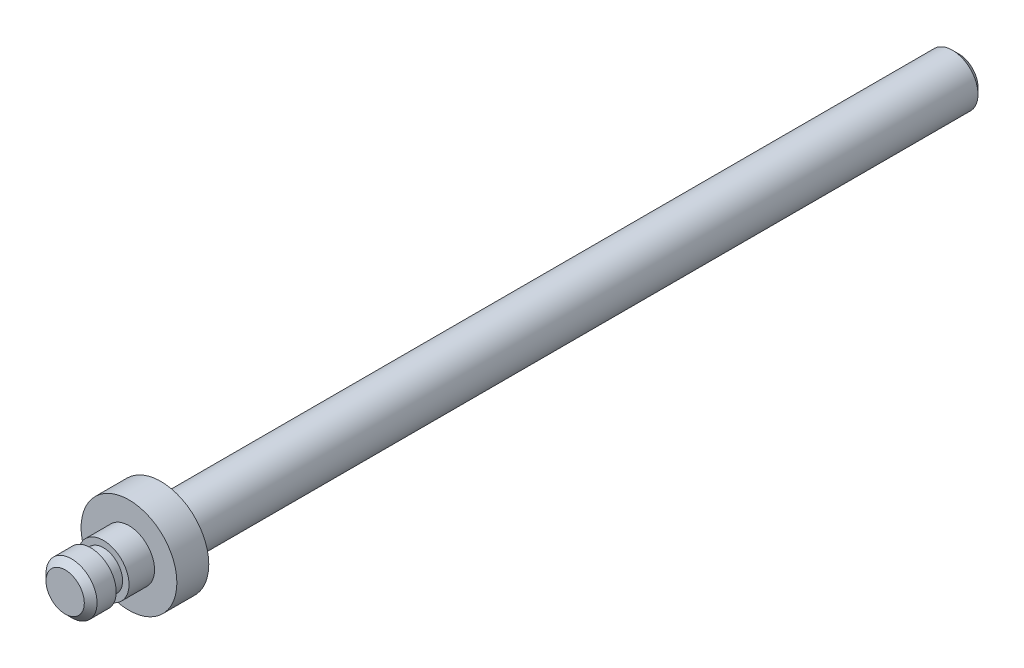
ISO-10303-21;
HEADER;
FILE_DESCRIPTION(('STEP AP214'),'2;1');
FILE_NAME('part.step','',(''),(''),'','','');
FILE_SCHEMA(('AUTOMOTIVE_DESIGN { 1 0 10303 214 1 1 1 1 }'));
ENDSEC;
DATA;
#1=APPLICATION_CONTEXT('core data for automotive mechanical design processes');
#2=APPLICATION_PROTOCOL_DEFINITION('international standard','automotive_design',2000,#1);
#3=PRODUCT_CONTEXT('',#1,'mechanical');
#4=PRODUCT('Part','Part','',(#3));
#5=PRODUCT_RELATED_PRODUCT_CATEGORY('part','',(#4));
#6=PRODUCT_DEFINITION_FORMATION('','',#4);
#7=PRODUCT_DEFINITION_CONTEXT('part definition',#1,'design');
#8=PRODUCT_DEFINITION('design','',#6,#7);
#9=PRODUCT_DEFINITION_SHAPE('','',#8);
#10=(LENGTH_UNIT() NAMED_UNIT(*) SI_UNIT(.MILLI.,.METRE.));
#11=(NAMED_UNIT(*) PLANE_ANGLE_UNIT() SI_UNIT($,.RADIAN.));
#12=(NAMED_UNIT(*) SI_UNIT($,.STERADIAN.) SOLID_ANGLE_UNIT());
#13=UNCERTAINTY_MEASURE_WITH_UNIT(LENGTH_MEASURE(1.E-05),#10,'distance_accuracy_value','');
#14=(GEOMETRIC_REPRESENTATION_CONTEXT(3) GLOBAL_UNCERTAINTY_ASSIGNED_CONTEXT((#13)) GLOBAL_UNIT_ASSIGNED_CONTEXT((#10,
#11,#12)) REPRESENTATION_CONTEXT('',''));
#15=CARTESIAN_POINT('',(0.,0.,0.));
#16=DIRECTION('',(0.,0.,1.));
#17=DIRECTION('',(1.,0.,0.));
#18=AXIS2_PLACEMENT_3D('',#15,#16,#17);
#19=CARTESIAN_POINT('',(0.,0.,140.));
#20=DIRECTION('',(0.,0.,-1.));
#21=DIRECTION('',(-1.,0.,0.));
#22=AXIS2_PLACEMENT_3D('',#19,#20,#21);
#23=CYLINDRICAL_SURFACE('',#22,4.);
#24=CARTESIAN_POINT('',(0.,0.,130.));
#25=DIRECTION('',(0.,0.,1.));
#26=DIRECTION('',(1.,0.,0.));
#27=AXIS2_PLACEMENT_3D('',#24,#25,#26);
#28=CIRCLE('',#27,4.);
#29=CARTESIAN_POINT('',(4.,0.,130.));
#30=VERTEX_POINT('',#29);
#31=EDGE_CURVE('E56',#30,#30,#28,.T.);
#32=ORIENTED_EDGE('',*,*,#31,.T.);
#33=EDGE_LOOP('',(#32));
#34=FACE_BOUND('',#33,.T.);
#35=CARTESIAN_POINT('',(0.,0.,134.));
#36=DIRECTION('',(0.,0.,1.));
#37=DIRECTION('',(1.,0.,0.));
#38=AXIS2_PLACEMENT_3D('',#35,#36,#37);
#39=CIRCLE('',#38,4.);
#40=CARTESIAN_POINT('',(4.,0.,134.));
#41=VERTEX_POINT('',#40);
#42=EDGE_CURVE('E61',#41,#41,#39,.T.);
#43=ORIENTED_EDGE('',*,*,#42,.F.);
#44=EDGE_LOOP('',(#43));
#45=FACE_BOUND('',#44,.T.);
#46=ADVANCED_FACE('F29',(#34,#45),#23,.T.);
#47=CARTESIAN_POINT('',(0.,0.,130.));
#48=DIRECTION('',(0.,0.,1.));
#49=DIRECTION('',(1.,0.,0.));
#50=AXIS2_PLACEMENT_3D('',#47,#48,#49);
#51=PLANE('',#50);
#52=CARTESIAN_POINT('',(0.,0.,130.));
#53=DIRECTION('',(0.,0.,1.));
#54=DIRECTION('',(1.,0.,0.));
#55=AXIS2_PLACEMENT_3D('',#52,#53,#54);
#56=CIRCLE('',#55,7.5);
#57=CARTESIAN_POINT('',(7.5,0.,130.));
#58=VERTEX_POINT('',#57);
#59=EDGE_CURVE('E52',#58,#58,#56,.T.);
#60=ORIENTED_EDGE('',*,*,#59,.T.);
#61=EDGE_LOOP('',(#60));
#62=FACE_BOUND('',#61,.T.);
#63=ORIENTED_EDGE('',*,*,#31,.F.);
#64=EDGE_LOOP('',(#63));
#65=FACE_BOUND('',#64,.T.);
#66=ADVANCED_FACE('F86',(#62,#65),#51,.T.);
#67=CARTESIAN_POINT('',(0.,0.,125.));
#68=DIRECTION('',(0.,0.,-1.));
#69=DIRECTION('',(-1.,0.,0.));
#70=AXIS2_PLACEMENT_3D('',#67,#68,#69);
#71=CYLINDRICAL_SURFACE('',#70,4.);
#72=CARTESIAN_POINT('',(0.,0.,0.999999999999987));
#73=DIRECTION('',(0.,0.,1.));
#74=DIRECTION('',(1.,0.,0.));
#75=AXIS2_PLACEMENT_3D('',#72,#73,#74);
#76=CIRCLE('',#75,4.);
#77=CARTESIAN_POINT('',(4.,0.,0.999999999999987));
#78=VERTEX_POINT('',#77);
#79=EDGE_CURVE('E44',#78,#78,#76,.T.);
#80=ORIENTED_EDGE('',*,*,#79,.T.);
#81=EDGE_LOOP('',(#80));
#82=FACE_BOUND('',#81,.T.);
#83=CARTESIAN_POINT('',(0.,0.,125.));
#84=DIRECTION('',(0.,0.,1.));
#85=DIRECTION('',(1.,0.,0.));
#86=AXIS2_PLACEMENT_3D('',#83,#84,#85);
#87=CIRCLE('',#86,4.);
#88=CARTESIAN_POINT('',(4.,0.,125.));
#89=VERTEX_POINT('',#88);
#90=EDGE_CURVE('E49',#89,#89,#87,.T.);
#91=ORIENTED_EDGE('',*,*,#90,.F.);
#92=EDGE_LOOP('',(#91));
#93=FACE_BOUND('',#92,.T.);
#94=ADVANCED_FACE('F93',(#82,#93),#71,.T.);
#95=CARTESIAN_POINT('',(0.,0.,0.));
#96=DIRECTION('',(0.,0.,1.));
#97=DIRECTION('',(1.,0.,0.));
#98=AXIS2_PLACEMENT_3D('',#95,#96,#97);
#99=PLANE('',#98);
#100=CARTESIAN_POINT('',(0.,0.,0.));
#101=DIRECTION('',(0.,0.,1.));
#102=DIRECTION('',(1.,0.,0.));
#103=AXIS2_PLACEMENT_3D('',#100,#101,#102);
#104=CIRCLE('',#103,3.00000000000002);
#105=CARTESIAN_POINT('',(3.00000000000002,0.,0.));
#106=VERTEX_POINT('',#105);
#107=EDGE_CURVE('E40',#106,#106,#104,.F.);
#108=ORIENTED_EDGE('',*,*,#107,.T.);
#109=EDGE_LOOP('',(#108));
#110=FACE_BOUND('',#109,.T.);
#111=ADVANCED_FACE('F174',(#110),#99,.F.);
#112=CARTESIAN_POINT('',(0.,0.,125.));
#113=DIRECTION('',(0.,0.,1.));
#114=DIRECTION('',(1.,0.,0.));
#115=AXIS2_PLACEMENT_3D('',#112,#113,#114);
#116=PLANE('',#115);
#117=CARTESIAN_POINT('',(0.,0.,125.));
#118=DIRECTION('',(0.,0.,1.));
#119=DIRECTION('',(1.,0.,0.));
#120=AXIS2_PLACEMENT_3D('',#117,#118,#119);
#121=CIRCLE('',#120,7.5);
#122=CARTESIAN_POINT('',(7.5,0.,125.));
#123=VERTEX_POINT('',#122);
#124=EDGE_CURVE('E53',#123,#123,#121,.T.);
#125=ORIENTED_EDGE('',*,*,#124,.F.);
#126=EDGE_LOOP('',(#125));
#127=FACE_BOUND('',#126,.T.);
#128=ORIENTED_EDGE('',*,*,#90,.T.);
#129=EDGE_LOOP('',(#128));
#130=FACE_BOUND('',#129,.T.);
#131=ADVANCED_FACE('F166',(#127,#130),#116,.F.);
#132=CARTESIAN_POINT('',(0.,0.,130.));
#133=DIRECTION('',(0.,0.,-1.));
#134=DIRECTION('',(-1.,0.,0.));
#135=AXIS2_PLACEMENT_3D('',#132,#133,#134);
#136=CYLINDRICAL_SURFACE('',#135,7.5);
#137=ORIENTED_EDGE('',*,*,#59,.F.);
#138=EDGE_LOOP('',(#137));
#139=FACE_BOUND('',#138,.T.);
#140=ORIENTED_EDGE('',*,*,#124,.T.);
#141=EDGE_LOOP('',(#140));
#142=FACE_BOUND('',#141,.T.);
#143=ADVANCED_FACE('F162',(#139,#142),#136,.T.);
#144=CARTESIAN_POINT('',(0.,0.,0.999999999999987));
#145=DIRECTION('',(0.,0.,1.));
#146=DIRECTION('',(1.,0.,0.));
#147=AXIS2_PLACEMENT_3D('',#144,#145,#146);
#148=CONICAL_SURFACE('',#147,4.,0.785398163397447);
#149=ORIENTED_EDGE('',*,*,#107,.F.);
#150=EDGE_LOOP('',(#149));
#151=FACE_BOUND('',#150,.T.);
#152=ORIENTED_EDGE('',*,*,#79,.F.);
#153=EDGE_LOOP('',(#152));
#154=FACE_BOUND('',#153,.T.);
#155=ADVANCED_FACE('F81',(#151,#154),#148,.T.);
#156=CARTESIAN_POINT('',(0.,0.,134.));
#157=DIRECTION('',(0.,0.,1.));
#158=DIRECTION('',(1.,0.,0.));
#159=AXIS2_PLACEMENT_3D('',#156,#157,#158);
#160=PLANE('',#159);
#161=CARTESIAN_POINT('',(0.,0.,134.));
#162=DIRECTION('',(0.,0.,1.));
#163=DIRECTION('',(1.,0.,0.));
#164=AXIS2_PLACEMENT_3D('',#161,#162,#163);
#165=CIRCLE('',#164,3.);
#166=CARTESIAN_POINT('',(3.,0.,134.));
#167=VERTEX_POINT('',#166);
#168=EDGE_CURVE('E65',#167,#167,#165,.T.);
#169=ORIENTED_EDGE('',*,*,#168,.F.);
#170=EDGE_LOOP('',(#169));
#171=FACE_BOUND('',#170,.T.);
#172=ORIENTED_EDGE('',*,*,#42,.T.);
#173=EDGE_LOOP('',(#172));
#174=FACE_BOUND('',#173,.T.);
#175=ADVANCED_FACE('F77',(#171,#174),#160,.T.);
#176=CARTESIAN_POINT('',(0.,0.,136.));
#177=DIRECTION('',(0.,0.,1.));
#178=DIRECTION('',(1.,0.,0.));
#179=AXIS2_PLACEMENT_3D('',#176,#177,#178);
#180=PLANE('',#179);
#181=CARTESIAN_POINT('',(0.,0.,136.));
#182=DIRECTION('',(0.,0.,1.));
#183=DIRECTION('',(1.,0.,0.));
#184=AXIS2_PLACEMENT_3D('',#181,#182,#183);
#185=CIRCLE('',#184,3.);
#186=CARTESIAN_POINT('',(3.,0.,136.));
#187=VERTEX_POINT('',#186);
#188=EDGE_CURVE('E68',#187,#187,#185,.T.);
#189=ORIENTED_EDGE('',*,*,#188,.T.);
#190=EDGE_LOOP('',(#189));
#191=FACE_BOUND('',#190,.T.);
#192=CARTESIAN_POINT('',(0.,0.,136.));
#193=DIRECTION('',(0.,0.,1.));
#194=DIRECTION('',(1.,0.,0.));
#195=AXIS2_PLACEMENT_3D('',#192,#193,#194);
#196=CIRCLE('',#195,4.);
#197=CARTESIAN_POINT('',(4.,0.,136.));
#198=VERTEX_POINT('',#197);
#199=EDGE_CURVE('E62',#198,#198,#196,.T.);
#200=ORIENTED_EDGE('',*,*,#199,.F.);
#201=EDGE_LOOP('',(#200));
#202=FACE_BOUND('',#201,.T.);
#203=ADVANCED_FACE('F80',(#191,#202),#180,.F.);
#204=CARTESIAN_POINT('',(0.,0.,134.));
#205=DIRECTION('',(0.,0.,1.));
#206=DIRECTION('',(1.,0.,0.));
#207=AXIS2_PLACEMENT_3D('',#204,#205,#206);
#208=CYLINDRICAL_SURFACE('',#207,3.);
#209=ORIENTED_EDGE('',*,*,#168,.T.);
#210=EDGE_LOOP('',(#209));
#211=FACE_BOUND('',#210,.T.);
#212=ORIENTED_EDGE('',*,*,#188,.F.);
#213=EDGE_LOOP('',(#212));
#214=FACE_BOUND('',#213,.T.);
#215=ADVANCED_FACE('F74',(#211,#214),#208,.T.);
#216=CARTESIAN_POINT('',(0.,0.,140.));
#217=DIRECTION('',(0.,0.,1.));
#218=DIRECTION('',(1.,0.,0.));
#219=AXIS2_PLACEMENT_3D('',#216,#217,#218);
#220=PLANE('',#219);
#221=CARTESIAN_POINT('',(0.,0.,140.));
#222=DIRECTION('',(0.,0.,1.));
#223=DIRECTION('',(1.,0.,0.));
#224=AXIS2_PLACEMENT_3D('',#221,#222,#223);
#225=CIRCLE('',#224,3.);
#226=CARTESIAN_POINT('',(3.,0.,140.));
#227=VERTEX_POINT('',#226);
#228=EDGE_CURVE('E36',#227,#227,#225,.T.);
#229=ORIENTED_EDGE('',*,*,#228,.T.);
#230=EDGE_LOOP('',(#229));
#231=FACE_BOUND('',#230,.T.);
#232=ADVANCED_FACE('F102',(#231),#220,.T.);
#233=CARTESIAN_POINT('',(0.,0.,140.));
#234=DIRECTION('',(0.,0.,-1.));
#235=DIRECTION('',(-1.,0.,0.));
#236=AXIS2_PLACEMENT_3D('',#233,#234,#235);
#237=CONICAL_SURFACE('',#236,3.,0.785398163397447);
#238=CARTESIAN_POINT('',(0.,0.,139.));
#239=DIRECTION('',(0.,0.,1.));
#240=DIRECTION('',(1.,0.,0.));
#241=AXIS2_PLACEMENT_3D('',#238,#239,#240);
#242=CIRCLE('',#241,4.);
#243=CARTESIAN_POINT('',(4.,0.,139.));
#244=VERTEX_POINT('',#243);
#245=EDGE_CURVE('E10',#244,#244,#242,.F.);
#246=ORIENTED_EDGE('',*,*,#245,.F.);
#247=EDGE_LOOP('',(#246));
#248=FACE_BOUND('',#247,.T.);
#249=ORIENTED_EDGE('',*,*,#228,.F.);
#250=EDGE_LOOP('',(#249));
#251=FACE_BOUND('',#250,.T.);
#252=ADVANCED_FACE('F31',(#248,#251),#237,.T.);
#253=ORIENTED_EDGE('',*,*,#199,.T.);
#254=EDGE_LOOP('',(#253));
#255=FACE_BOUND('',#254,.T.);
#256=ORIENTED_EDGE('',*,*,#245,.T.);
#257=EDGE_LOOP('',(#256));
#258=FACE_BOUND('',#257,.T.);
#259=ADVANCED_FACE('F89',(#255,#258),#23,.T.);
#260=CLOSED_SHELL('',(#46,#66,#94,#111,#131,#143,#155,#175,#203,#215,#232,#252,#259));
#261=MANIFOLD_SOLID_BREP('B2',#260);
#262=ADVANCED_BREP_SHAPE_REPRESENTATION('',(#18,#261),#14);
#263=SHAPE_DEFINITION_REPRESENTATION(#9,#262);
ENDSEC;
END-ISO-10303-21;
